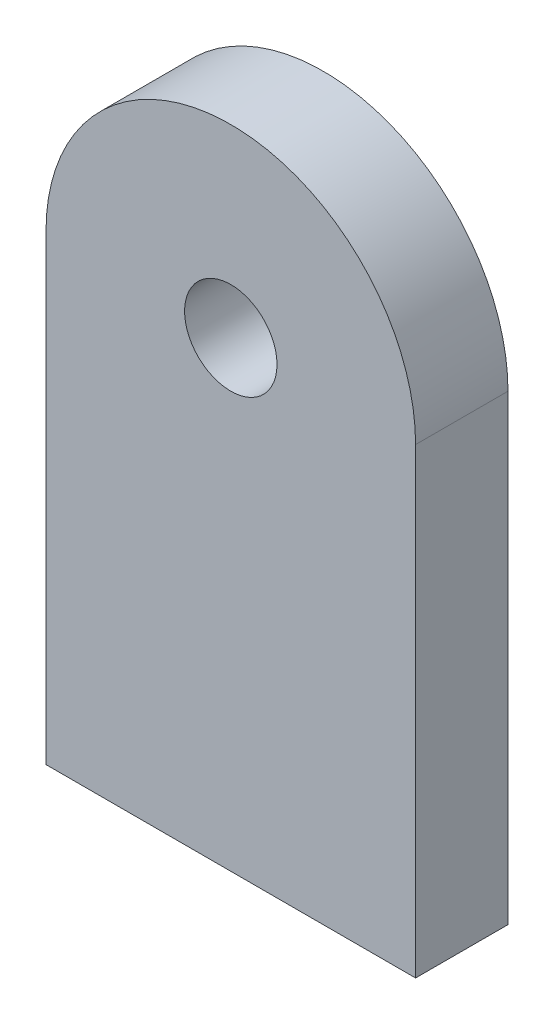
ISO-10303-21;
HEADER;
FILE_DESCRIPTION(('STEP AP214'),'2;1');
FILE_NAME('part.step','',(''),(''),'','','');
FILE_SCHEMA(('AUTOMOTIVE_DESIGN { 1 0 10303 214 1 1 1 1 }'));
ENDSEC;
DATA;
#1=APPLICATION_CONTEXT('core data for automotive mechanical design processes');
#2=APPLICATION_PROTOCOL_DEFINITION('international standard','automotive_design',2000,#1);
#3=PRODUCT_CONTEXT('',#1,'mechanical');
#4=PRODUCT('Part','Part','',(#3));
#5=PRODUCT_RELATED_PRODUCT_CATEGORY('part','',(#4));
#6=PRODUCT_DEFINITION_FORMATION('','',#4);
#7=PRODUCT_DEFINITION_CONTEXT('part definition',#1,'design');
#8=PRODUCT_DEFINITION('design','',#6,#7);
#9=PRODUCT_DEFINITION_SHAPE('','',#8);
#10=(LENGTH_UNIT() NAMED_UNIT(*) SI_UNIT(.MILLI.,.METRE.));
#11=(NAMED_UNIT(*) PLANE_ANGLE_UNIT() SI_UNIT($,.RADIAN.));
#12=(NAMED_UNIT(*) SI_UNIT($,.STERADIAN.) SOLID_ANGLE_UNIT());
#13=UNCERTAINTY_MEASURE_WITH_UNIT(LENGTH_MEASURE(1.E-05),#10,'distance_accuracy_value','');
#14=(GEOMETRIC_REPRESENTATION_CONTEXT(3) GLOBAL_UNCERTAINTY_ASSIGNED_CONTEXT((#13)) GLOBAL_UNIT_ASSIGNED_CONTEXT((#10,
#11,#12)) REPRESENTATION_CONTEXT('',''));
#15=CARTESIAN_POINT('',(0.,0.,0.));
#16=DIRECTION('',(0.,0.,1.));
#17=DIRECTION('',(1.,0.,0.));
#18=AXIS2_PLACEMENT_3D('',#15,#16,#17);
#19=CARTESIAN_POINT('',(40.,0.,10.));
#20=DIRECTION('',(0.,1.,0.));
#21=DIRECTION('',(-1.,0.,0.));
#22=AXIS2_PLACEMENT_3D('',#19,#20,#21);
#23=PLANE('',#22);
#24=DIRECTION('',(1.,0.,0.));
#25=VECTOR('',#24,1.);
#26=CARTESIAN_POINT('',(40.,0.,0.));
#27=LINE('',#26,#25);
#28=CARTESIAN_POINT('',(0.,0.,0.));
#29=VERTEX_POINT('',#28);
#30=CARTESIAN_POINT('',(40.,0.,0.));
#31=VERTEX_POINT('',#30);
#32=EDGE_CURVE('E96',#29,#31,#27,.T.);
#33=ORIENTED_EDGE('',*,*,#32,.T.);
#34=DIRECTION('',(0.,0.,-1.));
#35=VECTOR('',#34,1.);
#36=CARTESIAN_POINT('',(40.,0.,10.));
#37=LINE('',#36,#35);
#38=CARTESIAN_POINT('',(40.,0.,10.));
#39=VERTEX_POINT('',#38);
#40=EDGE_CURVE('E11',#39,#31,#37,.T.);
#41=ORIENTED_EDGE('',*,*,#40,.F.);
#42=DIRECTION('',(1.,0.,0.));
#43=VECTOR('',#42,1.);
#44=CARTESIAN_POINT('',(40.,0.,10.));
#45=LINE('',#44,#43);
#46=CARTESIAN_POINT('',(0.,0.,10.));
#47=VERTEX_POINT('',#46);
#48=EDGE_CURVE('E84',#47,#39,#45,.T.);
#49=ORIENTED_EDGE('',*,*,#48,.F.);
#50=DIRECTION('',(0.,0.,-1.));
#51=VECTOR('',#50,1.);
#52=CARTESIAN_POINT('',(0.,0.,10.));
#53=LINE('',#52,#51);
#54=EDGE_CURVE('E92',#47,#29,#53,.T.);
#55=ORIENTED_EDGE('',*,*,#54,.T.);
#56=EDGE_LOOP('',(#33,#41,#49,#55));
#57=FACE_BOUND('',#56,.T.);
#58=ADVANCED_FACE('F33',(#57),#23,.F.);
#59=CARTESIAN_POINT('',(39.9999999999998,50.,10.));
#60=DIRECTION('',(-1.,0.,0.));
#61=DIRECTION('',(0.,-1.,0.));
#62=AXIS2_PLACEMENT_3D('',#59,#60,#61);
#63=PLANE('',#62);
#64=DIRECTION('',(0.,1.,0.));
#65=VECTOR('',#64,1.);
#66=CARTESIAN_POINT('',(39.9999999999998,50.,0.));
#67=LINE('',#66,#65);
#68=CARTESIAN_POINT('',(39.9999999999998,50.,0.));
#69=VERTEX_POINT('',#68);
#70=EDGE_CURVE('E88',#31,#69,#67,.T.);
#71=ORIENTED_EDGE('',*,*,#70,.T.);
#72=DIRECTION('',(0.,0.,-1.));
#73=VECTOR('',#72,1.);
#74=CARTESIAN_POINT('',(39.9999999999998,50.,10.));
#75=LINE('',#74,#73);
#76=CARTESIAN_POINT('',(39.9999999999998,50.,10.));
#77=VERTEX_POINT('',#76);
#78=EDGE_CURVE('E41',#77,#69,#75,.T.);
#79=ORIENTED_EDGE('',*,*,#78,.F.);
#80=DIRECTION('',(0.,1.,0.));
#81=VECTOR('',#80,1.);
#82=CARTESIAN_POINT('',(39.9999999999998,50.,10.));
#83=LINE('',#82,#81);
#84=EDGE_CURVE('E79',#39,#77,#83,.T.);
#85=ORIENTED_EDGE('',*,*,#84,.F.);
#86=ORIENTED_EDGE('',*,*,#40,.T.);
#87=EDGE_LOOP('',(#71,#79,#85,#86));
#88=FACE_BOUND('',#87,.T.);
#89=ADVANCED_FACE('F87',(#88),#63,.F.);
#90=CARTESIAN_POINT('',(20.,49.9999999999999,10.));
#91=DIRECTION('',(0.,0.,-1.));
#92=DIRECTION('',(-1.,0.,0.));
#93=AXIS2_PLACEMENT_3D('',#90,#91,#92);
#94=CYLINDRICAL_SURFACE('',#93,19.9999999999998);
#95=CARTESIAN_POINT('',(20.,49.9999999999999,0.));
#96=DIRECTION('',(0.,0.,1.));
#97=DIRECTION('',(-1.,0.,0.));
#98=AXIS2_PLACEMENT_3D('',#95,#96,#97);
#99=CIRCLE('',#98,19.9999999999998);
#100=CARTESIAN_POINT('',(1.6845083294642E-13,50.,0.));
#101=VERTEX_POINT('',#100);
#102=EDGE_CURVE('E66',#69,#101,#99,.T.);
#103=ORIENTED_EDGE('',*,*,#102,.T.);
#104=DIRECTION('',(0.,0.,-1.));
#105=VECTOR('',#104,1.);
#106=CARTESIAN_POINT('',(1.6845083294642E-13,50.,10.));
#107=LINE('',#106,#105);
#108=CARTESIAN_POINT('',(1.6845083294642E-13,50.,10.));
#109=VERTEX_POINT('',#108);
#110=EDGE_CURVE('E89',#109,#101,#107,.T.);
#111=ORIENTED_EDGE('',*,*,#110,.F.);
#112=CARTESIAN_POINT('',(20.,49.9999999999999,10.));
#113=DIRECTION('',(0.,0.,1.));
#114=DIRECTION('',(-1.,0.,0.));
#115=AXIS2_PLACEMENT_3D('',#112,#113,#114);
#116=CIRCLE('',#115,19.9999999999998);
#117=EDGE_CURVE('E82',#77,#109,#116,.T.);
#118=ORIENTED_EDGE('',*,*,#117,.F.);
#119=ORIENTED_EDGE('',*,*,#78,.T.);
#120=EDGE_LOOP('',(#103,#111,#118,#119));
#121=FACE_BOUND('',#120,.T.);
#122=ADVANCED_FACE('F90',(#121),#94,.T.);
#123=CARTESIAN_POINT('',(0.,0.,10.));
#124=DIRECTION('',(1.,0.,0.));
#125=DIRECTION('',(0.,1.,0.));
#126=AXIS2_PLACEMENT_3D('',#123,#124,#125);
#127=PLANE('',#126);
#128=DIRECTION('',(0.,-1.,0.));
#129=VECTOR('',#128,1.);
#130=CARTESIAN_POINT('',(0.,0.,0.));
#131=LINE('',#130,#129);
#132=EDGE_CURVE('E72',#101,#29,#131,.T.);
#133=ORIENTED_EDGE('',*,*,#132,.T.);
#134=ORIENTED_EDGE('',*,*,#54,.F.);
#135=DIRECTION('',(0.,-1.,0.));
#136=VECTOR('',#135,1.);
#137=CARTESIAN_POINT('',(0.,0.,10.));
#138=LINE('',#137,#136);
#139=EDGE_CURVE('E49',#109,#47,#138,.T.);
#140=ORIENTED_EDGE('',*,*,#139,.F.);
#141=ORIENTED_EDGE('',*,*,#110,.T.);
#142=EDGE_LOOP('',(#133,#134,#140,#141));
#143=FACE_BOUND('',#142,.T.);
#144=ADVANCED_FACE('F104',(#143),#127,.F.);
#145=CARTESIAN_POINT('',(20.,49.9999999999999,10.));
#146=DIRECTION('',(0.,0.,-1.));
#147=DIRECTION('',(-1.,0.,0.));
#148=AXIS2_PLACEMENT_3D('',#145,#146,#147);
#149=PLANE('',#148);
#150=CARTESIAN_POINT('',(20.,49.9999999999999,10.));
#151=DIRECTION('',(0.,0.,1.));
#152=DIRECTION('',(1.,0.,0.));
#153=AXIS2_PLACEMENT_3D('',#150,#151,#152);
#154=CIRCLE('',#153,5.);
#155=CARTESIAN_POINT('',(25.,49.9999999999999,10.));
#156=VERTEX_POINT('',#155);
#157=EDGE_CURVE('E110',#156,#156,#154,.T.);
#158=ORIENTED_EDGE('',*,*,#157,.F.);
#159=EDGE_LOOP('',(#158));
#160=FACE_BOUND('',#159,.T.);
#161=ORIENTED_EDGE('',*,*,#48,.T.);
#162=ORIENTED_EDGE('',*,*,#84,.T.);
#163=ORIENTED_EDGE('',*,*,#117,.T.);
#164=ORIENTED_EDGE('',*,*,#139,.T.);
#165=EDGE_LOOP('',(#161,#162,#163,#164));
#166=FACE_BOUND('',#165,.T.);
#167=ADVANCED_FACE('F80',(#160,#166),#149,.F.);
#168=CARTESIAN_POINT('',(20.,49.9999999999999,0.));
#169=DIRECTION('',(0.,0.,-1.));
#170=DIRECTION('',(-1.,0.,0.));
#171=AXIS2_PLACEMENT_3D('',#168,#169,#170);
#172=PLANE('',#171);
#173=CARTESIAN_POINT('',(20.,49.9999999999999,0.));
#174=DIRECTION('',(0.,0.,1.));
#175=DIRECTION('',(1.,0.,0.));
#176=AXIS2_PLACEMENT_3D('',#173,#174,#175);
#177=CIRCLE('',#176,5.);
#178=CARTESIAN_POINT('',(25.,49.9999999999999,0.));
#179=VERTEX_POINT('',#178);
#180=EDGE_CURVE('E99',#179,#179,#177,.T.);
#181=ORIENTED_EDGE('',*,*,#180,.T.);
#182=EDGE_LOOP('',(#181));
#183=FACE_BOUND('',#182,.T.);
#184=ORIENTED_EDGE('',*,*,#32,.F.);
#185=ORIENTED_EDGE('',*,*,#132,.F.);
#186=ORIENTED_EDGE('',*,*,#102,.F.);
#187=ORIENTED_EDGE('',*,*,#70,.F.);
#188=EDGE_LOOP('',(#184,#185,#186,#187));
#189=FACE_BOUND('',#188,.T.);
#190=ADVANCED_FACE('F107',(#183,#189),#172,.T.);
#191=CARTESIAN_POINT('',(20.,49.9999999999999,0.));
#192=DIRECTION('',(0.,0.,1.));
#193=DIRECTION('',(1.,0.,0.));
#194=AXIS2_PLACEMENT_3D('',#191,#192,#193);
#195=CYLINDRICAL_SURFACE('',#194,5.);
#196=ORIENTED_EDGE('',*,*,#180,.F.);
#197=EDGE_LOOP('',(#196));
#198=FACE_BOUND('',#197,.T.);
#199=ORIENTED_EDGE('',*,*,#157,.T.);
#200=EDGE_LOOP('',(#199));
#201=FACE_BOUND('',#200,.T.);
#202=ADVANCED_FACE('F117',(#198,#201),#195,.F.);
#203=CLOSED_SHELL('',(#58,#89,#122,#144,#167,#190,#202));
#204=MANIFOLD_SOLID_BREP('B2',#203);
#205=ADVANCED_BREP_SHAPE_REPRESENTATION('',(#18,#204),#14);
#206=SHAPE_DEFINITION_REPRESENTATION(#9,#205);
ENDSEC;
END-ISO-10303-21;
